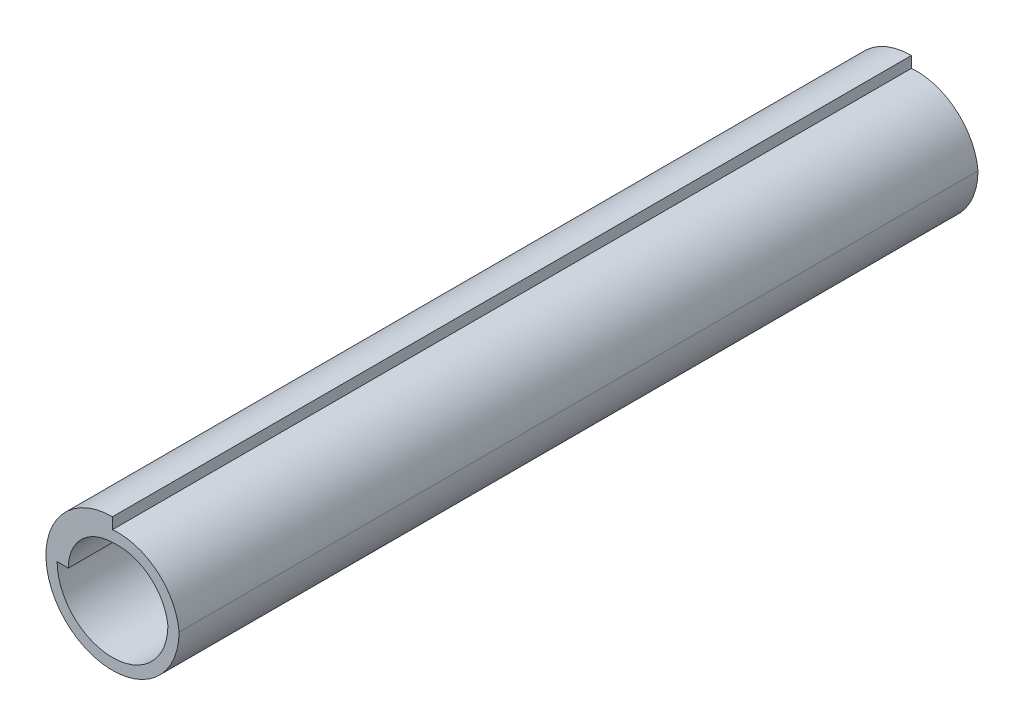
ISO-10303-21;
HEADER;
FILE_DESCRIPTION(('STEP AP214'),'2;1');
FILE_NAME('part.step','',(''),(''),'','','');
FILE_SCHEMA(('AUTOMOTIVE_DESIGN { 1 0 10303 214 1 1 1 1 }'));
ENDSEC;
DATA;
#1=APPLICATION_CONTEXT('core data for automotive mechanical design processes');
#2=APPLICATION_PROTOCOL_DEFINITION('international standard','automotive_design',2000,#1);
#3=PRODUCT_CONTEXT('',#1,'mechanical');
#4=PRODUCT('Part','Part','',(#3));
#5=PRODUCT_RELATED_PRODUCT_CATEGORY('part','',(#4));
#6=PRODUCT_DEFINITION_FORMATION('','',#4);
#7=PRODUCT_DEFINITION_CONTEXT('part definition',#1,'design');
#8=PRODUCT_DEFINITION('design','',#6,#7);
#9=PRODUCT_DEFINITION_SHAPE('','',#8);
#10=(LENGTH_UNIT() NAMED_UNIT(*) SI_UNIT(.MILLI.,.METRE.));
#11=(NAMED_UNIT(*) PLANE_ANGLE_UNIT() SI_UNIT($,.RADIAN.));
#12=(NAMED_UNIT(*) SI_UNIT($,.STERADIAN.) SOLID_ANGLE_UNIT());
#13=UNCERTAINTY_MEASURE_WITH_UNIT(LENGTH_MEASURE(1.E-05),#10,'distance_accuracy_value','');
#14=(GEOMETRIC_REPRESENTATION_CONTEXT(3) GLOBAL_UNCERTAINTY_ASSIGNED_CONTEXT((#13)) GLOBAL_UNIT_ASSIGNED_CONTEXT((#10,
#11,#12)) REPRESENTATION_CONTEXT('',''));
#15=CARTESIAN_POINT('',(0.,0.,0.));
#16=DIRECTION('',(0.,0.,1.));
#17=DIRECTION('',(1.,0.,0.));
#18=AXIS2_PLACEMENT_3D('',#15,#16,#17);
#19=CARTESIAN_POINT('',(0.209999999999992,-0.21000000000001,15.));
#20=DIRECTION('',(0.,0.,1.));
#21=DIRECTION('',(1.,0.,0.));
#22=AXIS2_PLACEMENT_3D('',#19,#20,#21);
#23=PLANE('',#22);
#24=CARTESIAN_POINT('',(0.209999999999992,-0.21000000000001,15.));
#25=DIRECTION('',(0.,0.,1.));
#26=DIRECTION('',(1.,0.,0.));
#27=AXIS2_PLACEMENT_3D('',#24,#25,#26);
#28=CIRCLE('',#27,2.29960866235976);
#29=CARTESIAN_POINT('',(2.5,0.,15.));
#30=VERTEX_POINT('',#29);
#31=CARTESIAN_POINT('',(0.,2.08,15.));
#32=VERTEX_POINT('',#31);
#33=EDGE_CURVE('E128',#30,#32,#28,.T.);
#34=ORIENTED_EDGE('',*,*,#33,.T.);
#35=DIRECTION('',(0.,1.,0.));
#36=VECTOR('',#35,1.);
#37=CARTESIAN_POINT('',(0.,2.08,15.));
#38=LINE('',#37,#36);
#39=CARTESIAN_POINT('',(0.,2.5,15.));
#40=VERTEX_POINT('',#39);
#41=EDGE_CURVE('E131',#32,#40,#38,.T.);
#42=ORIENTED_EDGE('',*,*,#41,.T.);
#43=CARTESIAN_POINT('',(0.,0.,15.));
#44=DIRECTION('',(0.,0.,1.));
#45=DIRECTION('',(1.,0.,0.));
#46=AXIS2_PLACEMENT_3D('',#43,#44,#45);
#47=CIRCLE('',#46,2.5);
#48=EDGE_CURVE('E134',#40,#30,#47,.T.);
#49=ORIENTED_EDGE('',*,*,#48,.T.);
#50=EDGE_LOOP('',(#34,#42,#49));
#51=FACE_BOUND('',#50,.T.);
#52=CARTESIAN_POINT('',(0.209999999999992,-0.21000000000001,15.));
#53=DIRECTION('',(0.,0.,1.));
#54=DIRECTION('',(1.,0.,0.));
#55=AXIS2_PLACEMENT_3D('',#52,#53,#54);
#56=CIRCLE('',#55,1.88175450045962);
#57=CARTESIAN_POINT('',(2.08,0.,15.));
#58=VERTEX_POINT('',#57);
#59=CARTESIAN_POINT('',(0.,1.66,15.));
#60=VERTEX_POINT('',#59);
#61=EDGE_CURVE('E100',#58,#60,#56,.T.);
#62=ORIENTED_EDGE('',*,*,#61,.F.);
#63=CARTESIAN_POINT('',(0.,0.,15.));
#64=DIRECTION('',(0.,0.,1.));
#65=DIRECTION('',(1.,0.,0.));
#66=AXIS2_PLACEMENT_3D('',#63,#64,#65);
#67=CIRCLE('',#66,2.08);
#68=CARTESIAN_POINT('',(-2.08,0.,15.));
#69=VERTEX_POINT('',#68);
#70=EDGE_CURVE('E92',#69,#58,#67,.T.);
#71=ORIENTED_EDGE('',*,*,#70,.F.);
#72=DIRECTION('',(-1.,0.,0.));
#73=VECTOR('',#72,1.);
#74=CARTESIAN_POINT('',(-2.08,0.,15.));
#75=LINE('',#74,#73);
#76=CARTESIAN_POINT('',(-1.66,0.,15.));
#77=VERTEX_POINT('',#76);
#78=EDGE_CURVE('E114',#77,#69,#75,.T.);
#79=ORIENTED_EDGE('',*,*,#78,.F.);
#80=CARTESIAN_POINT('',(0.,0.,15.));
#81=DIRECTION('',(0.,0.,1.));
#82=DIRECTION('',(1.,0.,0.));
#83=AXIS2_PLACEMENT_3D('',#80,#81,#82);
#84=CIRCLE('',#83,1.66);
#85=EDGE_CURVE('E112',#60,#77,#84,.T.);
#86=ORIENTED_EDGE('',*,*,#85,.F.);
#87=EDGE_LOOP('',(#62,#71,#79,#86));
#88=FACE_BOUND('',#87,.T.);
#89=ADVANCED_FACE('F33',(#51,#88),#23,.T.);
#90=CARTESIAN_POINT('',(0.209999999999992,-0.21000000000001,-15.));
#91=DIRECTION('',(0.,0.,1.));
#92=DIRECTION('',(1.,0.,0.));
#93=AXIS2_PLACEMENT_3D('',#90,#91,#92);
#94=PLANE('',#93);
#95=CARTESIAN_POINT('',(0.209999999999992,-0.21000000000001,-15.));
#96=DIRECTION('',(0.,0.,1.));
#97=DIRECTION('',(1.,0.,0.));
#98=AXIS2_PLACEMENT_3D('',#95,#96,#97);
#99=CIRCLE('',#98,2.29960866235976);
#100=CARTESIAN_POINT('',(2.5,0.,-15.));
#101=VERTEX_POINT('',#100);
#102=CARTESIAN_POINT('',(0.,2.08,-15.));
#103=VERTEX_POINT('',#102);
#104=EDGE_CURVE('E108',#101,#103,#99,.T.);
#105=ORIENTED_EDGE('',*,*,#104,.F.);
#106=CARTESIAN_POINT('',(0.,0.,-15.));
#107=DIRECTION('',(0.,0.,1.));
#108=DIRECTION('',(1.,0.,0.));
#109=AXIS2_PLACEMENT_3D('',#106,#107,#108);
#110=CIRCLE('',#109,2.5);
#111=CARTESIAN_POINT('',(0.,2.5,-15.));
#112=VERTEX_POINT('',#111);
#113=EDGE_CURVE('E132',#112,#101,#110,.T.);
#114=ORIENTED_EDGE('',*,*,#113,.F.);
#115=DIRECTION('',(0.,1.,0.));
#116=VECTOR('',#115,1.);
#117=CARTESIAN_POINT('',(0.,2.08,-15.));
#118=LINE('',#117,#116);
#119=EDGE_CURVE('E139',#103,#112,#118,.T.);
#120=ORIENTED_EDGE('',*,*,#119,.F.);
#121=EDGE_LOOP('',(#105,#114,#120));
#122=FACE_BOUND('',#121,.T.);
#123=CARTESIAN_POINT('',(0.,0.,-15.));
#124=DIRECTION('',(0.,0.,1.));
#125=DIRECTION('',(1.,0.,0.));
#126=AXIS2_PLACEMENT_3D('',#123,#124,#125);
#127=CIRCLE('',#126,2.08);
#128=CARTESIAN_POINT('',(-2.08,0.,-15.));
#129=VERTEX_POINT('',#128);
#130=CARTESIAN_POINT('',(2.08,0.,-15.));
#131=VERTEX_POINT('',#130);
#132=EDGE_CURVE('E56',#129,#131,#127,.T.);
#133=ORIENTED_EDGE('',*,*,#132,.T.);
#134=CARTESIAN_POINT('',(0.209999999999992,-0.21000000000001,-15.));
#135=DIRECTION('',(0.,0.,1.));
#136=DIRECTION('',(1.,0.,0.));
#137=AXIS2_PLACEMENT_3D('',#134,#135,#136);
#138=CIRCLE('',#137,1.88175450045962);
#139=CARTESIAN_POINT('',(0.,1.66,-15.));
#140=VERTEX_POINT('',#139);
#141=EDGE_CURVE('E107',#131,#140,#138,.T.);
#142=ORIENTED_EDGE('',*,*,#141,.T.);
#143=CARTESIAN_POINT('',(0.,0.,-15.));
#144=DIRECTION('',(0.,0.,1.));
#145=DIRECTION('',(1.,0.,0.));
#146=AXIS2_PLACEMENT_3D('',#143,#144,#145);
#147=CIRCLE('',#146,1.66);
#148=CARTESIAN_POINT('',(-1.66,0.,-15.));
#149=VERTEX_POINT('',#148);
#150=EDGE_CURVE('E120',#140,#149,#147,.T.);
#151=ORIENTED_EDGE('',*,*,#150,.T.);
#152=DIRECTION('',(-1.,0.,0.));
#153=VECTOR('',#152,1.);
#154=CARTESIAN_POINT('',(-2.08,0.,-15.));
#155=LINE('',#154,#153);
#156=EDGE_CURVE('E101',#149,#129,#155,.T.);
#157=ORIENTED_EDGE('',*,*,#156,.T.);
#158=EDGE_LOOP('',(#133,#142,#151,#157));
#159=FACE_BOUND('',#158,.T.);
#160=ADVANCED_FACE('F153',(#122,#159),#94,.F.);
#161=CARTESIAN_POINT('',(0.209999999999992,-0.21000000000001,15.));
#162=DIRECTION('',(0.,0.,-1.));
#163=DIRECTION('',(-1.,0.,0.));
#164=AXIS2_PLACEMENT_3D('',#161,#162,#163);
#165=CYLINDRICAL_SURFACE('',#164,2.29960866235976);
#166=ORIENTED_EDGE('',*,*,#104,.T.);
#167=DIRECTION('',(0.,0.,-1.));
#168=VECTOR('',#167,1.);
#169=CARTESIAN_POINT('',(0.,2.08,15.));
#170=LINE('',#169,#168);
#171=EDGE_CURVE('E11',#32,#103,#170,.T.);
#172=ORIENTED_EDGE('',*,*,#171,.F.);
#173=ORIENTED_EDGE('',*,*,#33,.F.);
#174=DIRECTION('',(0.,0.,-1.));
#175=VECTOR('',#174,1.);
#176=CARTESIAN_POINT('',(2.5,0.,15.));
#177=LINE('',#176,#175);
#178=EDGE_CURVE('E136',#30,#101,#177,.T.);
#179=ORIENTED_EDGE('',*,*,#178,.T.);
#180=EDGE_LOOP('',(#166,#172,#173,#179));
#181=FACE_BOUND('',#180,.T.);
#182=ADVANCED_FACE('F35',(#181),#165,.T.);
#183=CARTESIAN_POINT('',(0.,2.08,15.));
#184=DIRECTION('',(-1.,0.,0.));
#185=DIRECTION('',(0.,0.,1.));
#186=AXIS2_PLACEMENT_3D('',#183,#184,#185);
#187=PLANE('',#186);
#188=ORIENTED_EDGE('',*,*,#119,.T.);
#189=DIRECTION('',(0.,0.,-1.));
#190=VECTOR('',#189,1.);
#191=CARTESIAN_POINT('',(0.,2.5,15.));
#192=LINE('',#191,#190);
#193=EDGE_CURVE('E41',#40,#112,#192,.T.);
#194=ORIENTED_EDGE('',*,*,#193,.F.);
#195=ORIENTED_EDGE('',*,*,#41,.F.);
#196=ORIENTED_EDGE('',*,*,#171,.T.);
#197=EDGE_LOOP('',(#188,#194,#195,#196));
#198=FACE_BOUND('',#197,.T.);
#199=ADVANCED_FACE('F159',(#198),#187,.F.);
#200=CARTESIAN_POINT('',(0.,0.,15.));
#201=DIRECTION('',(0.,0.,-1.));
#202=DIRECTION('',(-1.,0.,0.));
#203=AXIS2_PLACEMENT_3D('',#200,#201,#202);
#204=CYLINDRICAL_SURFACE('',#203,2.5);
#205=ORIENTED_EDGE('',*,*,#113,.T.);
#206=ORIENTED_EDGE('',*,*,#178,.F.);
#207=ORIENTED_EDGE('',*,*,#48,.F.);
#208=ORIENTED_EDGE('',*,*,#193,.T.);
#209=EDGE_LOOP('',(#205,#206,#207,#208));
#210=FACE_BOUND('',#209,.T.);
#211=ADVANCED_FACE('F148',(#210),#204,.T.);
#212=CARTESIAN_POINT('',(0.,0.,15.));
#213=DIRECTION('',(0.,0.,-1.));
#214=DIRECTION('',(-1.,0.,0.));
#215=AXIS2_PLACEMENT_3D('',#212,#213,#214);
#216=CYLINDRICAL_SURFACE('',#215,2.08);
#217=ORIENTED_EDGE('',*,*,#132,.F.);
#218=DIRECTION('',(0.,0.,-1.));
#219=VECTOR('',#218,1.);
#220=CARTESIAN_POINT('',(-2.08,0.,15.));
#221=LINE('',#220,#219);
#222=EDGE_CURVE('E96',#69,#129,#221,.T.);
#223=ORIENTED_EDGE('',*,*,#222,.F.);
#224=ORIENTED_EDGE('',*,*,#70,.T.);
#225=DIRECTION('',(0.,0.,-1.));
#226=VECTOR('',#225,1.);
#227=CARTESIAN_POINT('',(2.08,0.,15.));
#228=LINE('',#227,#226);
#229=EDGE_CURVE('E95',#58,#131,#228,.T.);
#230=ORIENTED_EDGE('',*,*,#229,.T.);
#231=EDGE_LOOP('',(#217,#223,#224,#230));
#232=FACE_BOUND('',#231,.T.);
#233=ADVANCED_FACE('F94',(#232),#216,.F.);
#234=CARTESIAN_POINT('',(0.209999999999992,-0.21000000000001,15.));
#235=DIRECTION('',(0.,0.,-1.));
#236=DIRECTION('',(-1.,0.,0.));
#237=AXIS2_PLACEMENT_3D('',#234,#235,#236);
#238=CYLINDRICAL_SURFACE('',#237,1.88175450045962);
#239=ORIENTED_EDGE('',*,*,#141,.F.);
#240=ORIENTED_EDGE('',*,*,#229,.F.);
#241=ORIENTED_EDGE('',*,*,#61,.T.);
#242=DIRECTION('',(0.,0.,-1.));
#243=VECTOR('',#242,1.);
#244=CARTESIAN_POINT('',(0.,1.66,15.));
#245=LINE('',#244,#243);
#246=EDGE_CURVE('E109',#60,#140,#245,.T.);
#247=ORIENTED_EDGE('',*,*,#246,.T.);
#248=EDGE_LOOP('',(#239,#240,#241,#247));
#249=FACE_BOUND('',#248,.T.);
#250=ADVANCED_FACE('F104',(#249),#238,.F.);
#251=CARTESIAN_POINT('',(0.,0.,15.));
#252=DIRECTION('',(0.,0.,-1.));
#253=DIRECTION('',(-1.,0.,0.));
#254=AXIS2_PLACEMENT_3D('',#251,#252,#253);
#255=CYLINDRICAL_SURFACE('',#254,1.66);
#256=ORIENTED_EDGE('',*,*,#150,.F.);
#257=ORIENTED_EDGE('',*,*,#246,.F.);
#258=ORIENTED_EDGE('',*,*,#85,.T.);
#259=DIRECTION('',(0.,0.,-1.));
#260=VECTOR('',#259,1.);
#261=CARTESIAN_POINT('',(-1.66,0.,15.));
#262=LINE('',#261,#260);
#263=EDGE_CURVE('E48',#77,#149,#262,.T.);
#264=ORIENTED_EDGE('',*,*,#263,.T.);
#265=EDGE_LOOP('',(#256,#257,#258,#264));
#266=FACE_BOUND('',#265,.T.);
#267=ADVANCED_FACE('F177',(#266),#255,.F.);
#268=CARTESIAN_POINT('',(-2.08,0.,15.));
#269=DIRECTION('',(0.,-1.,0.));
#270=DIRECTION('',(0.,0.,-1.));
#271=AXIS2_PLACEMENT_3D('',#268,#269,#270);
#272=PLANE('',#271);
#273=ORIENTED_EDGE('',*,*,#156,.F.);
#274=ORIENTED_EDGE('',*,*,#263,.F.);
#275=ORIENTED_EDGE('',*,*,#78,.T.);
#276=ORIENTED_EDGE('',*,*,#222,.T.);
#277=EDGE_LOOP('',(#273,#274,#275,#276));
#278=FACE_BOUND('',#277,.T.);
#279=ADVANCED_FACE('F180',(#278),#272,.T.);
#280=CLOSED_SHELL('',(#89,#160,#182,#199,#211,#233,#250,#267,#279));
#281=MANIFOLD_SOLID_BREP('B2',#280);
#282=ADVANCED_BREP_SHAPE_REPRESENTATION('',(#18,#281),#14);
#283=SHAPE_DEFINITION_REPRESENTATION(#9,#282);
ENDSEC;
END-ISO-10303-21;
